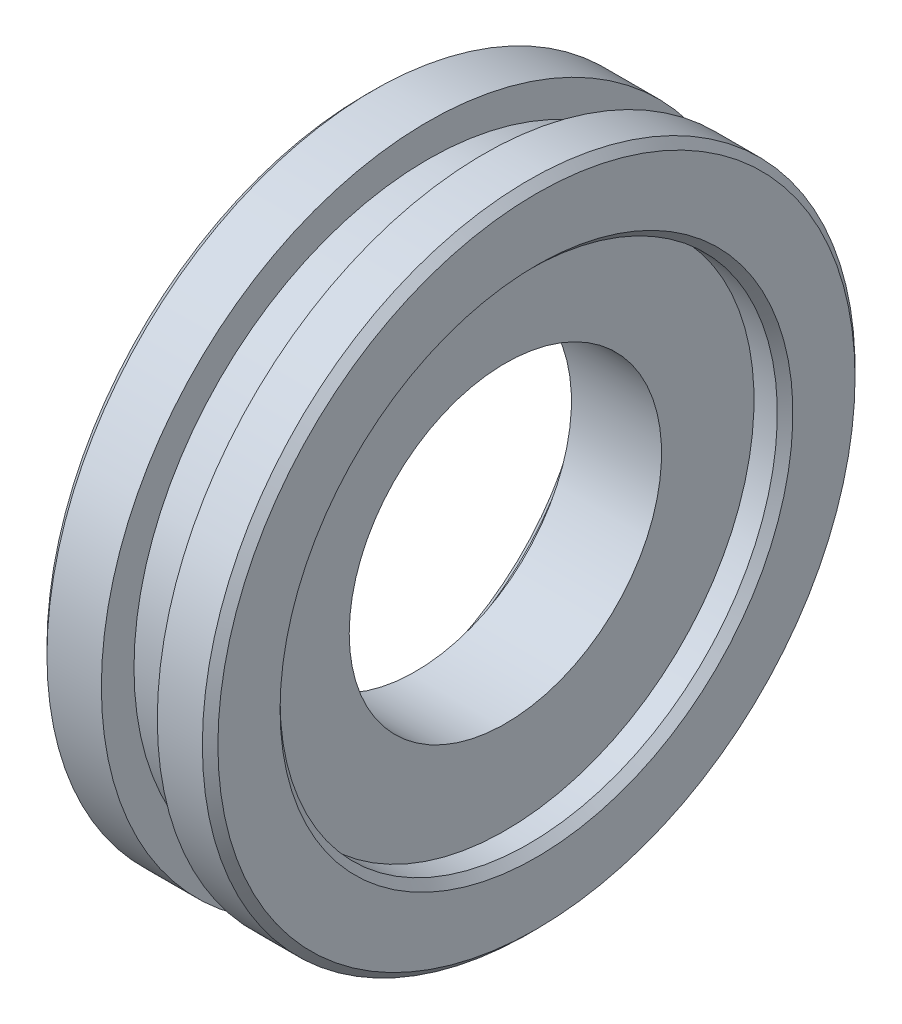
from build123d import *

# Parameters (mm, degrees)
CHANFREIN1_SIZE = 0.5


with BuildPart() as part:
    # Esquisse1 → R_volution1 (revolve)
    with BuildSketch(Plane.XY, mode=Mode.PRIVATE) as r_volution1_sk:
        Polygon((0, 21), (4, 21), (4, 18.9), (7.6, 18.9), (7.6, 21), (11, 21), (11, 16), (9, 16), (9, 10.05), (3.2, 10.05), (3.2, 13.75), (0, 13.75), align=None)
    revolve(r_volution1_sk.sketch.rotate(Axis((0, 0, 0), (1, 0, 0)), 90), axis=Axis((0, 0, 0), (1, 0, 0)))

    # Chanfrein1
    chanfrein1_edges = [part.edges().sort_by_distance(p)[0] for p in [
        (0, 0, -21),
        (0, 0, -13.75),
        (11, 0, -16),
        (11, 0, -21),
    ]]
    chamfer(chanfrein1_edges, length=CHANFREIN1_SIZE)


solid = part.part
